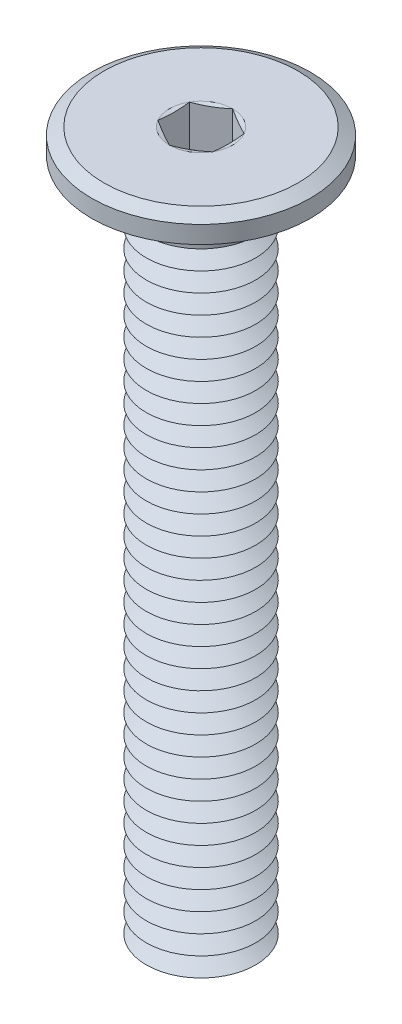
from build123d import *

# Parameters (mm, degrees)
SKETCH1_R           = 4
BOSS_EXTRUDE1_DEPTH = 0.9
SKETCH2_R           = 2
BOSS_EXTRUDE2_DEPTH = 25
LPATTERN1_COUNT     = 34
LPATTERN1_PITCH     = 0.7
FILLET1_R           = 0.2
CHAMFER2_SIZE       = 0.45
CHAMFER2_SIZE2      = 0.259807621
CUT_EXTRUDE1_DEPTH  = 1.5


with BuildPart() as part:
    # Sketch1 → Boss-Extrude1 (new body)
    with BuildSketch(Plane(origin=(0, 0, 0), x_dir=(1, 0, 0), z_dir=(0, 1, 0))):
        with Locations(Location((0, 0, 0), (0, 0, 270))):
            Circle(SKETCH1_R)
    extrude(amount=-BOSS_EXTRUDE1_DEPTH)

    # Sketch2 → Boss-Extrude2 (add)
    with BuildSketch(Plane.XZ.offset(0.9)):
        with Locations(Location((0, 0, 0), (0, 0, 270))):
            Circle(SKETCH2_R)
    extrude(amount=BOSS_EXTRUDE2_DEPTH)

    # Sketch5 → Cut-Revolve1 (revolve, cut)
    with BuildSketch(Plane(origin=(0, 0, 0), x_dir=(0, 0, -1), z_dir=(1, 0, 0))):
        Polygon((-2, -26.25), (-1.393782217, -25.9), (-2, -25.55), align=None)
    cut_revolve1 = revolve(axis=Axis((0, 0.990593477, 0), (0, -1, 0)), mode=Mode.SUBTRACT)

    # LPattern1: Cut-Revolve1 ×34
    with Locations(*[(0, i * LPATTERN1_PITCH, 0) for i in range(1, LPATTERN1_COUNT)]):
        add(cut_revolve1, mode=Mode.SUBTRACT)

    # Fillet1
    fillet1_edges = [part.edges().sort_by_distance(p)[0] for p in [
        (0, -0.9, 2),
    ]]
    fillet(fillet1_edges, radius=FILLET1_R)

    # Chamfer2
    chamfer2_edges = [part.edges().sort_by_distance(p)[0] for p in [
        (0, 0, -4),
    ]]
    chamfer2_side = [part.faces().sort_by_distance(p)[0] for p in [
        (0, 0, 0),
    ]]
    chamfer(chamfer2_edges, length=CHAMFER2_SIZE, length2=CHAMFER2_SIZE2, reference=chamfer2_side[0])

    # Sketch6 → Cut-Extrude1 (cut)
    with BuildSketch(Plane(origin=(0, 0, 0), x_dir=(1, 0, 0), z_dir=(0, 1, 0))):
        Polygon((0, 1.154700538), (-1, 0.577350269), (-1, -0.577350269), (0, -1.154700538), (1, -0.577350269), (1, 0.577350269), align=None)
    extrude(amount=-CUT_EXTRUDE1_DEPTH, mode=Mode.SUBTRACT)

    # Cut-Extrude2 cone 1 section (on through the dimple's axis) → Cut-Extrude2 (revolve, cut)
    with BuildSketch(Plane(origin=(0, -1.5, 0), x_dir=(0, 0, 1), z_dir=(1, 0, 0))):
        Polygon((0, 0), (1, 0), (0, 0.577350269), align=None)
    revolve(axis=Axis((0, -1.5, 0), (0, -1, 0)), mode=Mode.SUBTRACT)

    # Cut-Extrude3 cone 1 section (on through the dimple's axis) → Cut-Extrude3 (revolve, cut)
    with BuildSketch(Plane(origin=(0, 0, 0), x_dir=(0, 0, 1), z_dir=(1, 0, 0))):
        Polygon((0, 0), (1.154700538, 0), (0, 0.309401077), align=None)
    revolve(axis=Axis((0, 0, 0), (0, -1, 0)), mode=Mode.SUBTRACT)


solid = part.part
